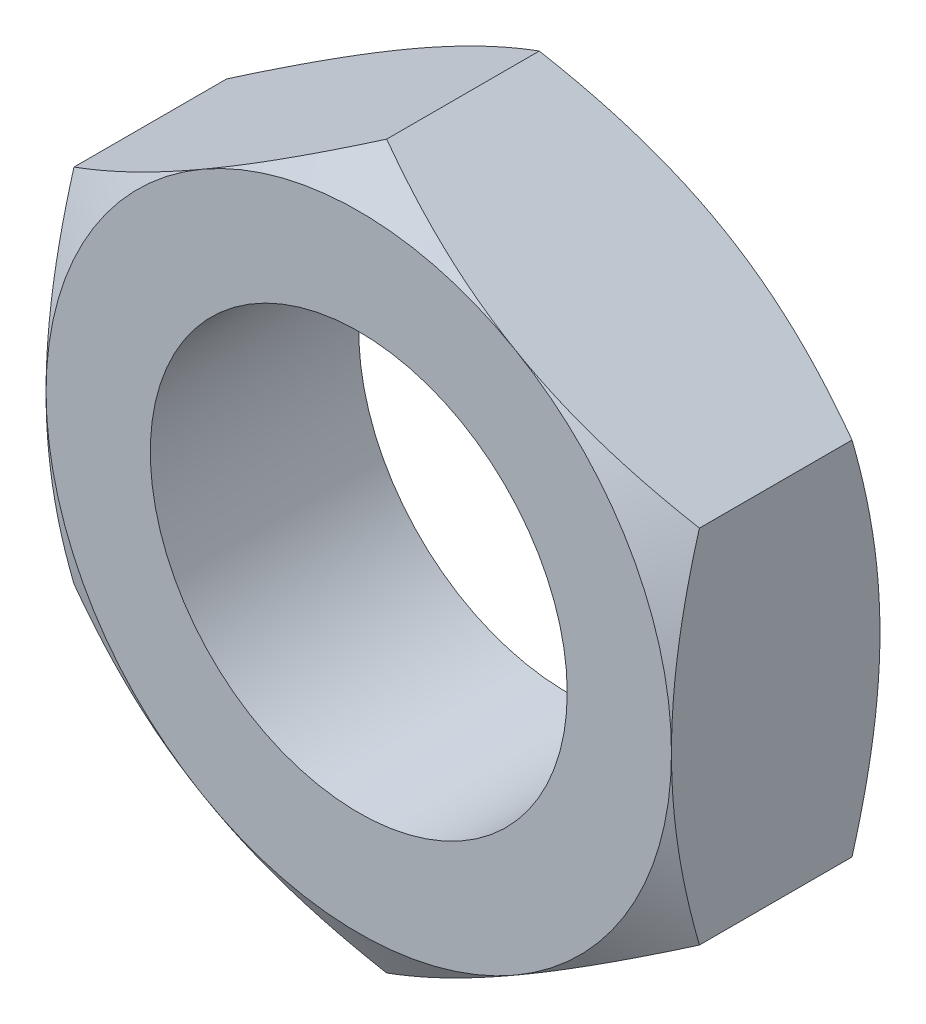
from build123d import *

# Parameters (mm, degrees)
BASE_EXTRUSION_DEPTH    = 7
ESQUISSE3_R             = 7
ENL_V_MAT_EXTRU_1_DEPTH = 18.5


with BuildPart() as part:
    # Esquisse1 → Base-Extrusion (new body)
    with BuildSketch(Plane.XY):
        Polygon((10.5, -6.062177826), (10.5, 6.062177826), (0, 12.124355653), (-10.5, 6.062177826), (-10.5, -6.062177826), (0, -12.124355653), align=None)
    extrude(amount=-BASE_EXTRUSION_DEPTH)

    # Esquisse2 → Enl_vement de mati_re-R_volution1 (revolve, cut)
    with BuildSketch(Plane(origin=(0, 0, 0), x_dir=(1, 0, 0), z_dir=(0, 1, 0))):
        Polygon((-10.5, 0), (-17.562177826, 0), (-17.562177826, 7), (-10.5, 7), (-16.562177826, 3.5), align=None)
    revolve(axis=Axis((0, 0, -7), (0, 0, 1)), mode=Mode.SUBTRACT)

    # Esquisse3 → Enl_v. mat.-Extru.1 (cut, through all)
    with BuildSketch(Plane.XY):
        Circle(ESQUISSE3_R)
    extrude(amount=-ENL_V_MAT_EXTRU_1_DEPTH, mode=Mode.SUBTRACT)


solid = part.part
